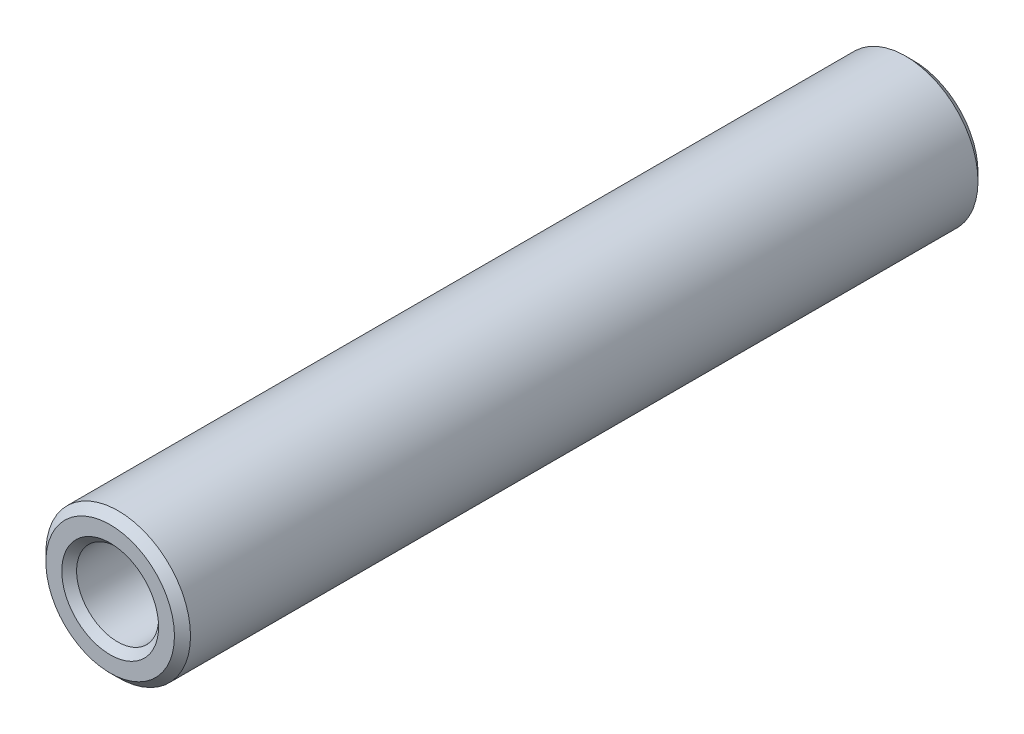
from build123d import *

# Parameters (mm, degrees)
ESQUISSE1_R                              = 9
BOSS_EXTRU_1_DEPTH                       = 100
CHANFREIN1_SIZE                          = 1
TARAUDAGE_M12_POU_EXTRACTION_D           = 10.2
TARAUDAGE_M12_POU_EXTRACTION_DEPTH       = 28.75
TARAUDAGE_M12_POU_EXTRACTION_CSINK_D     = 12.05
TARAUDAGE_M12_POU_EXTRACTION_CSINK_ANGLE = 90
TARAUDAGE_M12_POU_EXTRACTION_TIP         = 3.064389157


with BuildPart() as part:
    # Esquisse1 → Boss.-Extru.1 (new body)
    with BuildSketch(Plane.XY):
        Circle(ESQUISSE1_R)
    extrude(amount=BOSS_EXTRU_1_DEPTH)

    # Chanfrein1
    chanfrein1_edges = [part.edges().sort_by_distance(p)[0] for p in [
        (-9, 0, 0),
        (-9, 0, 100),
    ]]
    chamfer(chanfrein1_edges, length=CHANFREIN1_SIZE)

    # Taraudage M12 pou extraction
    with Locations(Plane.XY.offset(100)):
        with Locations((0, 0)):
            CounterSinkHole(TARAUDAGE_M12_POU_EXTRACTION_D / 2, TARAUDAGE_M12_POU_EXTRACTION_CSINK_D / 2, depth=TARAUDAGE_M12_POU_EXTRACTION_DEPTH, counter_sink_angle=TARAUDAGE_M12_POU_EXTRACTION_CSINK_ANGLE)
            with Locations((0, 0, -(TARAUDAGE_M12_POU_EXTRACTION_DEPTH + TARAUDAGE_M12_POU_EXTRACTION_TIP / 2))):  # 118° drill point
                Cone(0, TARAUDAGE_M12_POU_EXTRACTION_D / 2, TARAUDAGE_M12_POU_EXTRACTION_TIP, mode=Mode.SUBTRACT)


solid = part.part
